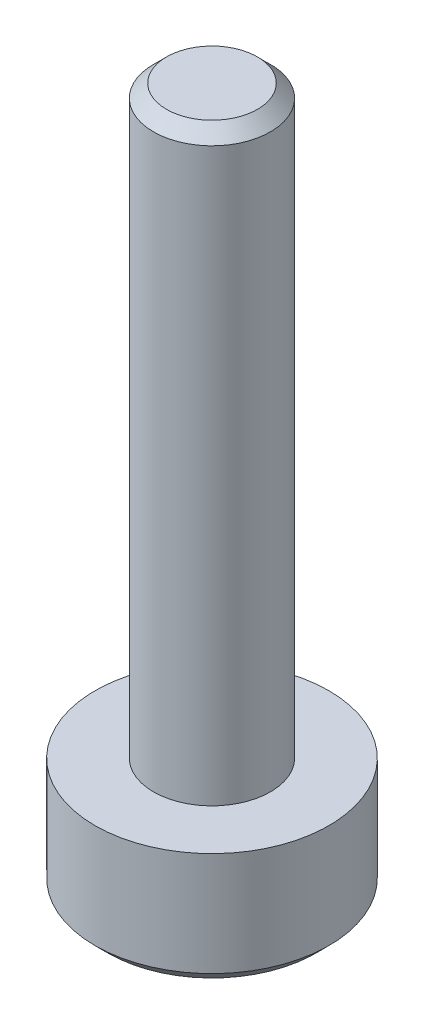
from build123d import *

# Parameters (mm, degrees)
SKETCH1_R           = 1.5
BOSS_EXTRUDE1_DEPTH = 15
SKETCH2_R           = 3
BOSS_EXTRUDE2_DEPTH = 3
CUT_EXTRUDE1_DEPTH  = 2
CHAMFER1_SIZE       = 0.333333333


with BuildPart() as part:
    # Sketch1 → Boss-Extrude1 (new body)
    with BuildSketch(Plane(origin=(0, 0, 0), x_dir=(1, 0, 0), z_dir=(0, 1, 0))):
        with Locations(Location((0, 0, 0), (0, 0, 270))):
            Circle(SKETCH1_R)
    extrude(amount=BOSS_EXTRUDE1_DEPTH)

    # Sketch2 → Boss-Extrude2 (add)
    with BuildSketch(Plane.XZ):
        with Locations(Location((0, 0, 0), (0, 0, 270))):
            Circle(SKETCH2_R)
    extrude(amount=BOSS_EXTRUDE2_DEPTH)

    # Sketch3 → Cut-Extrude1 (cut)
    with BuildSketch(Plane.XZ.offset(3)):
        Polygon((0, 1.732050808), (-1.5, 0.866025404), (-1.5, -0.866025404), (0, -1.732050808), (1.5, -0.866025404), (1.5, 0.866025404), align=None)
    extrude(amount=-CUT_EXTRUDE1_DEPTH, mode=Mode.SUBTRACT)

    # Chamfer1
    chamfer1_edges = [part.edges().sort_by_distance(p)[0] for p in [
        (0, 15, -1.5),
        (0, -3, 3),
    ]]
    chamfer(chamfer1_edges, length=CHAMFER1_SIZE)


solid = part.part
